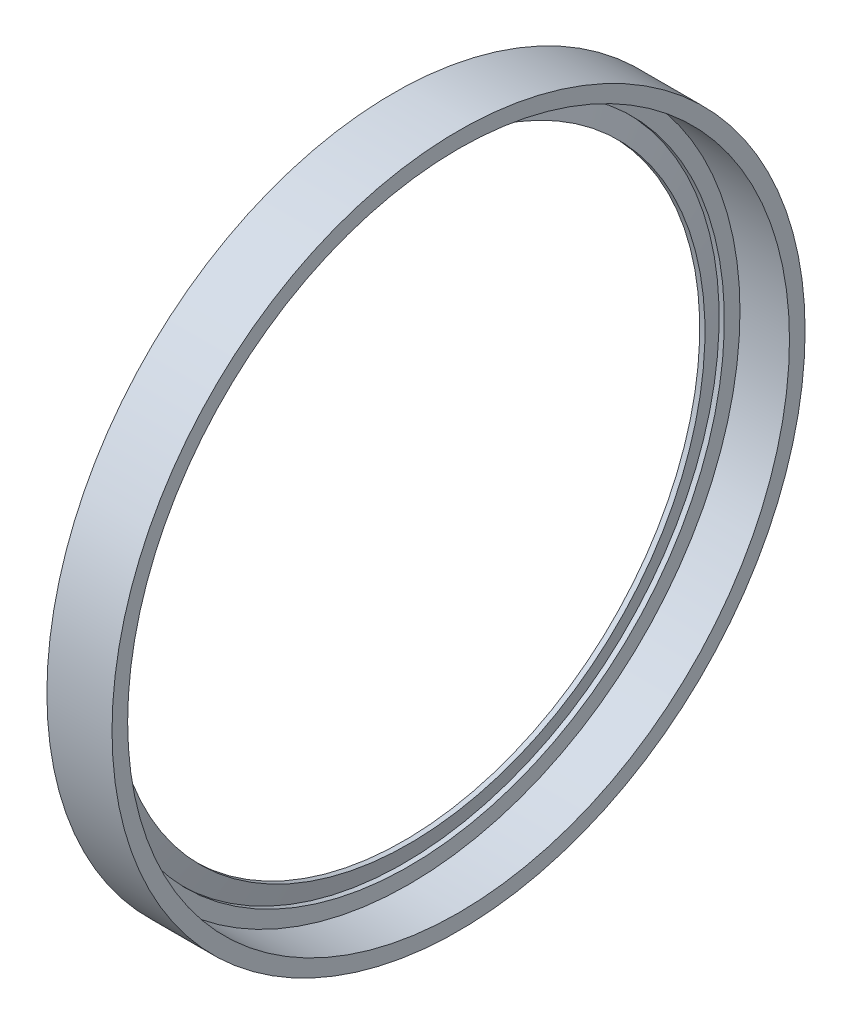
ISO-10303-21;
HEADER;
FILE_DESCRIPTION(('STEP AP214'),'2;1');
FILE_NAME('part.step','',(''),(''),'','','');
FILE_SCHEMA(('AUTOMOTIVE_DESIGN { 1 0 10303 214 1 1 1 1 }'));
ENDSEC;
DATA;
#1=APPLICATION_CONTEXT('core data for automotive mechanical design processes');
#2=APPLICATION_PROTOCOL_DEFINITION('international standard','automotive_design',2000,#1);
#3=PRODUCT_CONTEXT('',#1,'mechanical');
#4=PRODUCT('Part','Part','',(#3));
#5=PRODUCT_RELATED_PRODUCT_CATEGORY('part','',(#4));
#6=PRODUCT_DEFINITION_FORMATION('','',#4);
#7=PRODUCT_DEFINITION_CONTEXT('part definition',#1,'design');
#8=PRODUCT_DEFINITION('design','',#6,#7);
#9=PRODUCT_DEFINITION_SHAPE('','',#8);
#10=(LENGTH_UNIT() NAMED_UNIT(*) SI_UNIT(.MILLI.,.METRE.));
#11=(NAMED_UNIT(*) PLANE_ANGLE_UNIT() SI_UNIT($,.RADIAN.));
#12=(NAMED_UNIT(*) SI_UNIT($,.STERADIAN.) SOLID_ANGLE_UNIT());
#13=UNCERTAINTY_MEASURE_WITH_UNIT(LENGTH_MEASURE(1.E-05),#10,'distance_accuracy_value','');
#14=(GEOMETRIC_REPRESENTATION_CONTEXT(3) GLOBAL_UNCERTAINTY_ASSIGNED_CONTEXT((#13)) GLOBAL_UNIT_ASSIGNED_CONTEXT((#10,
#11,#12)) REPRESENTATION_CONTEXT('',''));
#15=CARTESIAN_POINT('',(0.,0.,0.));
#16=DIRECTION('',(0.,0.,1.));
#17=DIRECTION('',(1.,0.,0.));
#18=AXIS2_PLACEMENT_3D('',#15,#16,#17);
#19=CARTESIAN_POINT('',(0.,30.7467,0.));
#20=DIRECTION('',(1.,0.,0.));
#21=DIRECTION('',(0.,0.,-1.));
#22=AXIS2_PLACEMENT_3D('',#19,#20,#21);
#23=PLANE('',#22);
#24=CARTESIAN_POINT('',(0.,0.,0.));
#25=DIRECTION('',(-1.,0.,0.));
#26=DIRECTION('',(0.,0.,1.));
#27=AXIS2_PLACEMENT_3D('',#24,#25,#26);
#28=CIRCLE('',#27,30.7467);
#29=CARTESIAN_POINT('',(0.,0.,30.7467));
#30=VERTEX_POINT('',#29);
#31=EDGE_CURVE('E66',#30,#30,#28,.T.);
#32=ORIENTED_EDGE('',*,*,#31,.F.);
#33=EDGE_LOOP('',(#32));
#34=FACE_BOUND('',#33,.T.);
#35=CARTESIAN_POINT('',(0.,0.,0.));
#36=DIRECTION('',(-1.,0.,0.));
#37=DIRECTION('',(0.,0.,1.));
#38=AXIS2_PLACEMENT_3D('',#35,#36,#37);
#39=CIRCLE('',#38,33.7947);
#40=CARTESIAN_POINT('',(0.,0.,33.7947));
#41=VERTEX_POINT('',#40);
#42=EDGE_CURVE('E10',#41,#41,#39,.T.);
#43=ORIENTED_EDGE('',*,*,#42,.T.);
#44=EDGE_LOOP('',(#43));
#45=FACE_BOUND('',#44,.T.);
#46=ADVANCED_FACE('F32',(#34,#45),#23,.F.);
#47=CARTESIAN_POINT('',(-57.8017989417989,0.,0.));
#48=DIRECTION('',(-1.,0.,0.));
#49=DIRECTION('',(0.,0.,1.));
#50=AXIS2_PLACEMENT_3D('',#47,#48,#49);
#51=CYLINDRICAL_SURFACE('',#50,33.7947);
#52=ORIENTED_EDGE('',*,*,#42,.F.);
#53=EDGE_LOOP('',(#52));
#54=FACE_BOUND('',#53,.T.);
#55=CARTESIAN_POINT('',(6.34999999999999,0.,0.));
#56=DIRECTION('',(-1.,0.,0.));
#57=DIRECTION('',(0.,0.,1.));
#58=AXIS2_PLACEMENT_3D('',#55,#56,#57);
#59=CIRCLE('',#58,33.7947);
#60=CARTESIAN_POINT('',(6.34999999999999,0.,33.7947));
#61=VERTEX_POINT('',#60);
#62=EDGE_CURVE('E38',#61,#61,#59,.T.);
#63=ORIENTED_EDGE('',*,*,#62,.T.);
#64=EDGE_LOOP('',(#63));
#65=FACE_BOUND('',#64,.T.);
#66=ADVANCED_FACE('F73',(#54,#65),#51,.T.);
#67=CARTESIAN_POINT('',(6.35,33.7947,0.));
#68=DIRECTION('',(-1.,0.,0.));
#69=DIRECTION('',(0.,0.,1.));
#70=AXIS2_PLACEMENT_3D('',#67,#68,#69);
#71=PLANE('',#70);
#72=ORIENTED_EDGE('',*,*,#62,.F.);
#73=EDGE_LOOP('',(#72));
#74=FACE_BOUND('',#73,.T.);
#75=CARTESIAN_POINT('',(6.34999999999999,0.,0.));
#76=DIRECTION('',(-1.,0.,0.));
#77=DIRECTION('',(0.,0.,1.));
#78=AXIS2_PLACEMENT_3D('',#75,#76,#77);
#79=CIRCLE('',#78,32.2707);
#80=CARTESIAN_POINT('',(6.34999999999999,0.,32.2707));
#81=VERTEX_POINT('',#80);
#82=EDGE_CURVE('E42',#81,#81,#79,.T.);
#83=ORIENTED_EDGE('',*,*,#82,.T.);
#84=EDGE_LOOP('',(#83));
#85=FACE_BOUND('',#84,.T.);
#86=ADVANCED_FACE('F77',(#74,#85),#71,.F.);
#87=CARTESIAN_POINT('',(-57.8017989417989,0.,0.));
#88=DIRECTION('',(-1.,0.,0.));
#89=DIRECTION('',(0.,0.,1.));
#90=AXIS2_PLACEMENT_3D('',#87,#88,#89);
#91=CYLINDRICAL_SURFACE('',#90,32.2707);
#92=ORIENTED_EDGE('',*,*,#82,.F.);
#93=EDGE_LOOP('',(#92));
#94=FACE_BOUND('',#93,.T.);
#95=CARTESIAN_POINT('',(1.524,0.,0.));
#96=DIRECTION('',(-1.,0.,0.));
#97=DIRECTION('',(0.,0.,1.));
#98=AXIS2_PLACEMENT_3D('',#95,#96,#97);
#99=CIRCLE('',#98,32.2707);
#100=CARTESIAN_POINT('',(1.524,0.,32.2707));
#101=VERTEX_POINT('',#100);
#102=EDGE_CURVE('E46',#101,#101,#99,.T.);
#103=ORIENTED_EDGE('',*,*,#102,.T.);
#104=EDGE_LOOP('',(#103));
#105=FACE_BOUND('',#104,.T.);
#106=ADVANCED_FACE('F82',(#94,#105),#91,.F.);
#107=CARTESIAN_POINT('',(1.524,32.2707,0.));
#108=DIRECTION('',(-1.,0.,0.));
#109=DIRECTION('',(0.,0.,1.));
#110=AXIS2_PLACEMENT_3D('',#107,#108,#109);
#111=PLANE('',#110);
#112=ORIENTED_EDGE('',*,*,#102,.F.);
#113=EDGE_LOOP('',(#112));
#114=FACE_BOUND('',#113,.T.);
#115=CARTESIAN_POINT('',(1.524,0.,0.));
#116=DIRECTION('',(-1.,0.,0.));
#117=DIRECTION('',(0.,0.,1.));
#118=AXIS2_PLACEMENT_3D('',#115,#116,#117);
#119=CIRCLE('',#118,30.7467);
#120=CARTESIAN_POINT('',(1.524,0.,30.7467));
#121=VERTEX_POINT('',#120);
#122=EDGE_CURVE('E51',#121,#121,#119,.T.);
#123=ORIENTED_EDGE('',*,*,#122,.T.);
#124=EDGE_LOOP('',(#123));
#125=FACE_BOUND('',#124,.T.);
#126=ADVANCED_FACE('F88',(#114,#125),#111,.F.);
#127=CARTESIAN_POINT('',(-57.8017989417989,0.,0.));
#128=DIRECTION('',(-1.,0.,0.));
#129=DIRECTION('',(0.,0.,1.));
#130=AXIS2_PLACEMENT_3D('',#127,#128,#129);
#131=CYLINDRICAL_SURFACE('',#130,30.7467);
#132=ORIENTED_EDGE('',*,*,#122,.F.);
#133=EDGE_LOOP('',(#132));
#134=FACE_BOUND('',#133,.T.);
#135=CARTESIAN_POINT('',(1.016,0.,0.));
#136=DIRECTION('',(-1.,0.,0.));
#137=DIRECTION('',(0.,0.,1.));
#138=AXIS2_PLACEMENT_3D('',#135,#136,#137);
#139=CIRCLE('',#138,30.7467);
#140=CARTESIAN_POINT('',(1.016,0.,30.7467));
#141=VERTEX_POINT('',#140);
#142=EDGE_CURVE('E54',#141,#141,#139,.T.);
#143=ORIENTED_EDGE('',*,*,#142,.T.);
#144=EDGE_LOOP('',(#143));
#145=FACE_BOUND('',#144,.T.);
#146=ADVANCED_FACE('F92',(#134,#145),#131,.F.);
#147=CARTESIAN_POINT('',(1.524,0.,0.));
#148=DIRECTION('',(-1.,0.,0.));
#149=DIRECTION('',(0.,0.,1.));
#150=AXIS2_PLACEMENT_3D('',#147,#148,#149);
#151=CONICAL_SURFACE('',#150,28.8544,1.30852379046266);
#152=ORIENTED_EDGE('',*,*,#142,.F.);
#153=EDGE_LOOP('',(#152));
#154=FACE_BOUND('',#153,.T.);
#155=CARTESIAN_POINT('',(1.524,0.,0.));
#156=DIRECTION('',(-1.,0.,0.));
#157=DIRECTION('',(0.,0.,1.));
#158=AXIS2_PLACEMENT_3D('',#155,#156,#157);
#159=CIRCLE('',#158,28.8544);
#160=CARTESIAN_POINT('',(1.524,0.,28.8544));
#161=VERTEX_POINT('',#160);
#162=EDGE_CURVE('E57',#161,#161,#159,.T.);
#163=ORIENTED_EDGE('',*,*,#162,.T.);
#164=EDGE_LOOP('',(#163));
#165=FACE_BOUND('',#164,.T.);
#166=ADVANCED_FACE('F96',(#154,#165),#151,.T.);
#167=CARTESIAN_POINT('',(-57.8017989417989,0.,0.));
#168=DIRECTION('',(-1.,0.,0.));
#169=DIRECTION('',(0.,0.,1.));
#170=AXIS2_PLACEMENT_3D('',#167,#168,#169);
#171=CYLINDRICAL_SURFACE('',#170,28.8544);
#172=ORIENTED_EDGE('',*,*,#162,.F.);
#173=EDGE_LOOP('',(#172));
#174=FACE_BOUND('',#173,.T.);
#175=CARTESIAN_POINT('',(1.016,0.,0.));
#176=DIRECTION('',(-1.,0.,0.));
#177=DIRECTION('',(0.,0.,1.));
#178=AXIS2_PLACEMENT_3D('',#175,#176,#177);
#179=CIRCLE('',#178,28.8544);
#180=CARTESIAN_POINT('',(1.016,0.,28.8544));
#181=VERTEX_POINT('',#180);
#182=EDGE_CURVE('E60',#181,#181,#179,.T.);
#183=ORIENTED_EDGE('',*,*,#182,.T.);
#184=EDGE_LOOP('',(#183));
#185=FACE_BOUND('',#184,.T.);
#186=ADVANCED_FACE('F100',(#174,#185),#171,.F.);
#187=CARTESIAN_POINT('',(0.508000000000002,0.,0.));
#188=DIRECTION('',(-1.,0.,0.));
#189=DIRECTION('',(0.,0.,1.));
#190=AXIS2_PLACEMENT_3D('',#187,#188,#189);
#191=CONICAL_SURFACE('',#190,30.7467,1.30852379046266);
#192=ORIENTED_EDGE('',*,*,#182,.F.);
#193=EDGE_LOOP('',(#192));
#194=FACE_BOUND('',#193,.T.);
#195=CARTESIAN_POINT('',(0.508000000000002,0.,0.));
#196=DIRECTION('',(-1.,0.,0.));
#197=DIRECTION('',(0.,0.,1.));
#198=AXIS2_PLACEMENT_3D('',#195,#196,#197);
#199=CIRCLE('',#198,30.7467);
#200=CARTESIAN_POINT('',(0.508000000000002,0.,30.7467));
#201=VERTEX_POINT('',#200);
#202=EDGE_CURVE('E63',#201,#201,#199,.T.);
#203=ORIENTED_EDGE('',*,*,#202,.T.);
#204=EDGE_LOOP('',(#203));
#205=FACE_BOUND('',#204,.T.);
#206=ADVANCED_FACE('F104',(#194,#205),#191,.F.);
#207=CARTESIAN_POINT('',(-57.8017989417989,0.,0.));
#208=DIRECTION('',(-1.,0.,0.));
#209=DIRECTION('',(0.,0.,1.));
#210=AXIS2_PLACEMENT_3D('',#207,#208,#209);
#211=CYLINDRICAL_SURFACE('',#210,30.7467);
#212=ORIENTED_EDGE('',*,*,#202,.F.);
#213=EDGE_LOOP('',(#212));
#214=FACE_BOUND('',#213,.T.);
#215=ORIENTED_EDGE('',*,*,#31,.T.);
#216=EDGE_LOOP('',(#215));
#217=FACE_BOUND('',#216,.T.);
#218=ADVANCED_FACE('F70',(#214,#217),#211,.F.);
#219=CLOSED_SHELL('',(#46,#66,#86,#106,#126,#146,#166,#186,#206,#218));
#220=MANIFOLD_SOLID_BREP('B2',#219);
#221=ADVANCED_BREP_SHAPE_REPRESENTATION('',(#18,#220),#14);
#222=SHAPE_DEFINITION_REPRESENTATION(#9,#221);
ENDSEC;
END-ISO-10303-21;
